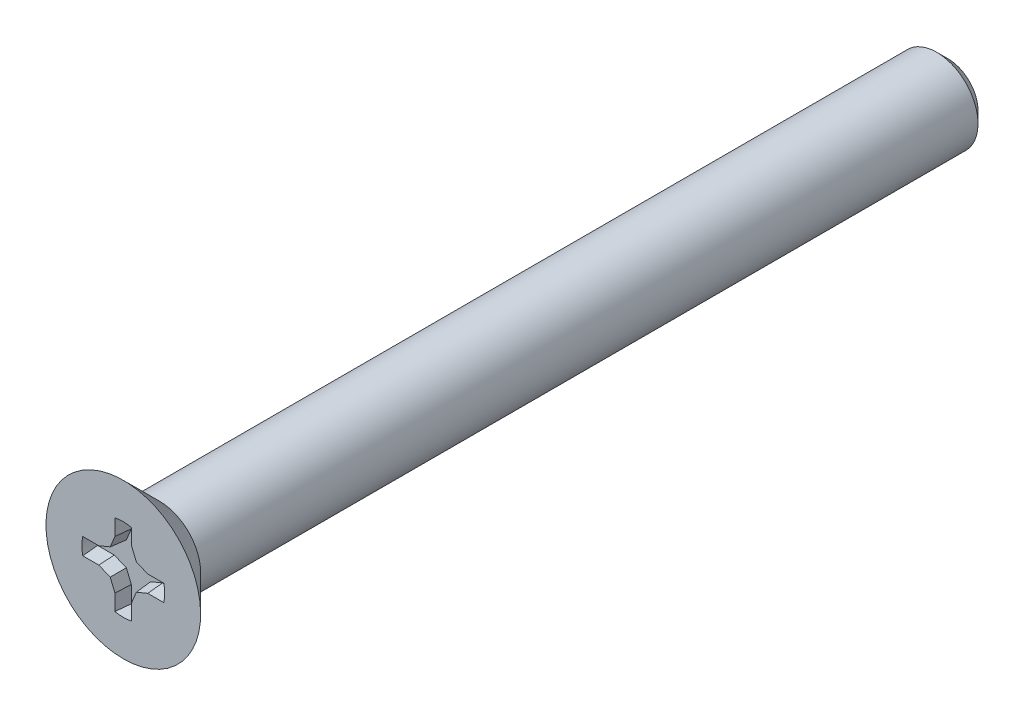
from build123d import *

# Parameters (mm, degrees)
CUT_EXTRUDE1_DEPTH = 0.733333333
CIRPATTERN1_COUNT  = 4
DRAFT2_ANGLE       = 5


with BuildPart() as part:
    # Sketch3 → Revolve1 (revolve)
    with BuildSketch(Plane(origin=(0, 0, 0), x_dir=(0, 0, -1), z_dir=(1, 0, 0)), mode=Mode.PRIVATE) as revolve1_sk:
        Polygon((-2.2, 0), (-2.2, 3.75), (-0.45, 2), (-0.45, 0), align=None)
    revolve(revolve1_sk.sketch.rotate(Axis((0, 0, 2.2), (0, 0, -1)), 180), axis=Axis((0, 0, 2.2), (0, 0, -1)))

    # Sketch5 → Revolve2 (revolve)
    with BuildSketch(Plane(origin=(0, 0, 0), x_dir=(0, 0, -1), z_dir=(1, 0, 0))):
        Polygon((37.8, 0), (-0.45, 0), (-0.45, 2), (37.247, 2), (37.8, 1.447), align=None)
    revolve(axis=Axis((0, 0, -37.8), (0, 0, 1)))

    # Sketch4 → Cut-Extrude1 (cut)
    with BuildSketch(Plane.XY.offset(2.2)):
        with BuildLine():
            Line((0, 0), (2.0066, 0))
            ThreePointArc((2.0066, 0), (1.996176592, 0.204261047), (1.965014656, 0.4064))
            Line((1.965014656, 0.4064), (1.185707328, 0.4064))
            Line((1.185707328, 0.4064), (0.634653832, 0.634653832))
            Line((0.634653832, 0.634653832), (0.4064, 1.185707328))
            Line((0.4064, 1.185707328), (0.4064, 1.965014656))
            ThreePointArc((0.4064, 1.965014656), (0.204261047, 1.996176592), (0, 2.0066))
            Line((0, 2.0066), (0, 0))
        make_face()
    cut_extrude1 = extrude(amount=-CUT_EXTRUDE1_DEPTH, mode=Mode.SUBTRACT)

    # CirPattern1: Cut-Extrude1 ×4 about axis
    cirpattern1_axis = Axis((0, 0, 0), (0, 0, 1))
    for i in range(1, CIRPATTERN1_COUNT):
        add(cut_extrude1.rotate(cirpattern1_axis, i * 360 / CIRPATTERN1_COUNT), mode=Mode.SUBTRACT)

    # Draft2
    draft2_faces = [part.faces().sort_by_distance(p)[0] for p in [
        (-1.575360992, 0.4064, 1.833333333),
        (-0.91018058, 0.520526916, 1.833333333),
        (-0.520526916, 0.91018058, 1.833333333),
        (-0.4064, 1.575360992, 1.833333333),
        (0.4064, 1.575360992, 1.833333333),
        (0.520526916, 0.91018058, 1.833333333),
        (0.91018058, 0.520526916, 1.833333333),
        (1.575360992, 0.4064, 1.833333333),
        (1.575360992, -0.4064, 1.833333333),
        (0.91018058, -0.520526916, 1.833333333),
        (0.520526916, -0.91018058, 1.833333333),
        (0.4064, -1.575360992, 1.833333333),
        (-0.4064, -1.575360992, 1.833333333),
        (-0.520526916, -0.91018058, 1.833333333),
        (-0.91018058, -0.520526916, 1.833333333),
        (-1.575360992, -0.4064, 1.833333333),
    ]]
    draft(draft2_faces, Plane(origin=(0, 0, 2.2), x_dir=(0, 1, 0), z_dir=(0, 0, 1)), DRAFT2_ANGLE)


solid = part.part
